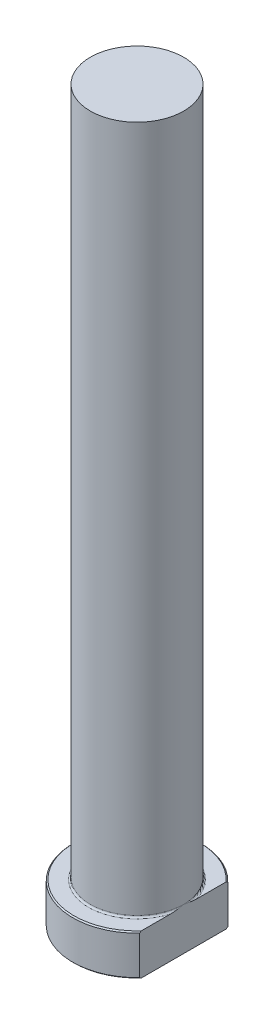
from build123d import *
from build123d.topology import SkipClean

# Parameters (mm, degrees)
CHAMFER1_SIZE = 0.2
FILLET1_R     = 0.3
KEY_DEPTH     = 126.964280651


with BuildPart() as part:
    # Sketch1 → Revolve1 (revolve)
    with BuildSketch(Plane.XY, mode=Mode.PRIVATE) as revolve1_sk:
        Polygon((0, 0), (-11, 0), (-11, 7), (-8, 7), (-8, 125), (0, 125), align=None)
    revolve(revolve1_sk.sketch.rotate(Axis((0, 259.958771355, 0), (0, -1, 0)), 270), axis=Axis((0, 259.958771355, 0), (0, -1, 0)))

    # Chamfer1
    chamfer1_edges = [part.edges().sort_by_distance(p)[0] for p in [
        (0, 7, -11),
        (0, 0, -11),
    ]]
    chamfer(chamfer1_edges, length=CHAMFER1_SIZE)

    # Fillet1
    fillet1_edges = [part.edges().sort_by_distance(p)[0] for p in [
        (0, 7, -8),
    ]]
    fillet(fillet1_edges, radius=FILLET1_R)

    # Sketch2 → KEY (cut, through all)
    with SkipClean():  # the faces are left unmerged after this step: merging them gives an invalid solid
        with BuildSketch(Plane(origin=(0, 0, 0), x_dir=(1, 0, 0), z_dir=(0, 1, 0))):
            with BuildLine():
                Line((8, 7.549834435), (8, -7.549834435))
                ThreePointArc((8, -7.549834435), (11, 0), (8, 7.549834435))
            make_face()
        extrude(amount=KEY_DEPTH, mode=Mode.SUBTRACT)


solid = part.part
